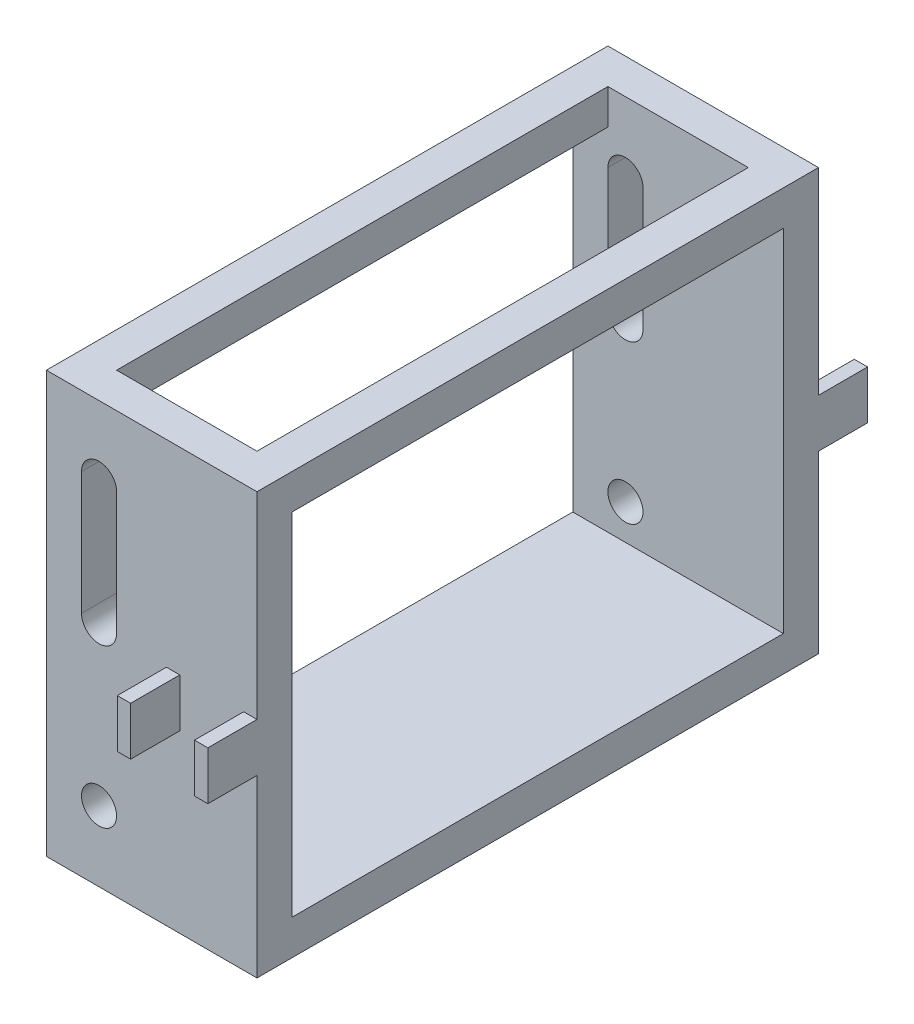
from build123d import *

# Parameters (mm, degrees)
SKETCH1_W           = 76.2
SKETCH1_H           = 203.2
BOSS_EXTRUDE1_DEPTH = 12.7
SKETCH2_W           = 76.2
SKETCH2_H           = 12.7
BOSS_EXTRUDE2_DEPTH = 127
SKETCH3_W           = 76.2
SKETCH3_H           = 203.2
SKETCH3_W_2         = 50.8
SKETCH3_H_2         = 177.8
BOSS_EXTRUDE3_DEPTH = 12.7
SKETCH4_R           = 6.35
CUT_EXTRUDE1_DEPTH  = 266.183785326
SKETCH5_W           = 4.826
SKETCH5_H           = 17.526
BOSS_EXTRUDE4_DEPTH = 17.78


with BuildPart() as part:
    # Sketch1 → Boss-Extrude1 (new body)
    with BuildSketch(Plane(origin=(0, 0, 0), x_dir=(1, 0, 0), z_dir=(0, 1, 0))):
        with Locations((38.1, 101.6)):
            Rectangle(SKETCH1_W, SKETCH1_H)
    extrude(amount=BOSS_EXTRUDE1_DEPTH)

    # Sketch2 → Boss-Extrude2 (add)
    with BuildSketch(Plane(origin=(0, 12.7, 0), x_dir=(1, 0, 0), z_dir=(0, 1, 0))):
        with Locations((38.1, 196.85)):
            Rectangle(SKETCH2_W, SKETCH2_H)
        with Locations((38.1, 6.35)):
            Rectangle(SKETCH2_W, SKETCH2_H)
    extrude(amount=BOSS_EXTRUDE2_DEPTH)

    # Sketch3 → Boss-Extrude3 (add)
    with BuildSketch(Plane(origin=(0, 139.7, 0), x_dir=(1, 0, 0), z_dir=(0, 1, 0))):
        with Locations((38.1, 101.6)):
            Rectangle(SKETCH3_W, SKETCH3_H)
        with Locations((38.1, 101.6)):
            Rectangle(SKETCH3_W_2, SKETCH3_H_2, mode=Mode.SUBTRACT)
    extrude(amount=BOSS_EXTRUDE3_DEPTH)

    # Sketch4 → Cut-Extrude1 (cut, through all)
    with BuildSketch(Plane.XY):
        with Locations((19.05, 25.4)):
            Circle(SKETCH4_R)
        with BuildLine():
            Line((12.7, 127), (12.7, 82.55))
            ThreePointArc((12.7, 82.55), (19.05, 76.2), (25.4, 82.55))
            Line((25.4, 82.55), (25.4, 127))
            ThreePointArc((25.4, 127), (19.05, 133.35), (12.7, 127))
        make_face()
    extrude(amount=-CUT_EXTRUDE1_DEPTH, mode=Mode.SUBTRACT)

    # Sketch5 → Boss-Extrude4 (add)
    with BuildSketch(Plane.XY):
        with Locations((73.787, 72.263)):
            Rectangle(SKETCH5_W, SKETCH5_H)
        with Locations((45.847, 72.263)):
            Rectangle(SKETCH5_W, SKETCH5_H)
    boss_extrude4 = extrude(amount=BOSS_EXTRUDE4_DEPTH)

    # Mirror1: Boss-Extrude4 across plane
    add(boss_extrude4.mirror(Plane.XY.offset(-101.6)))


solid = part.part
